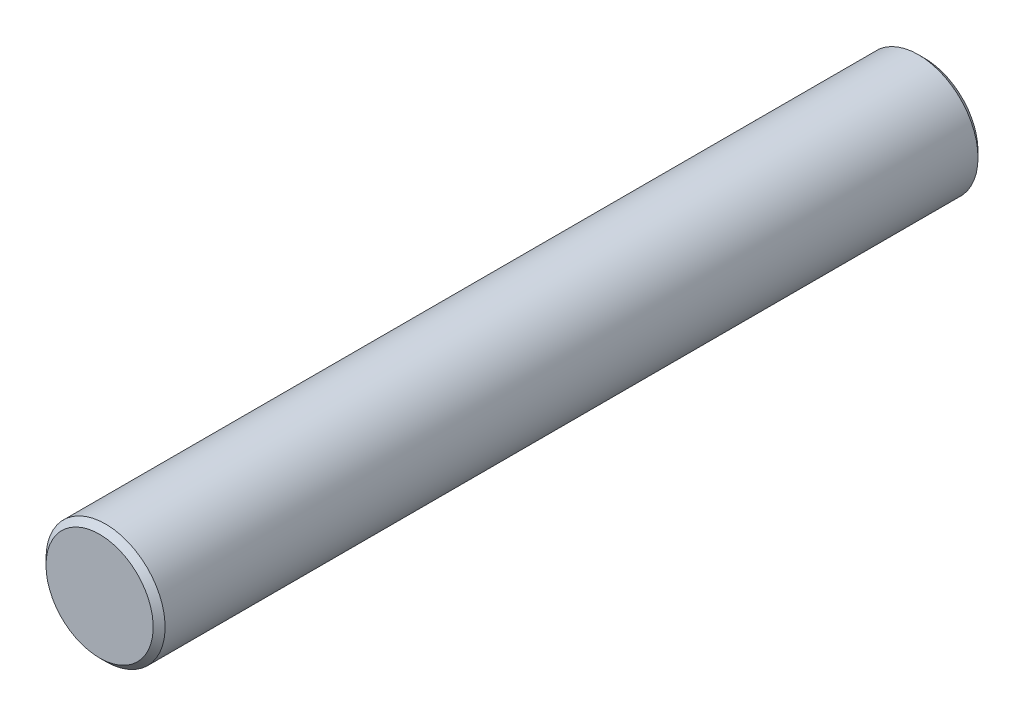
ISO-10303-21;
HEADER;
FILE_DESCRIPTION(('STEP AP214'),'2;1');
FILE_NAME('part.step','',(''),(''),'','','');
FILE_SCHEMA(('AUTOMOTIVE_DESIGN { 1 0 10303 214 1 1 1 1 }'));
ENDSEC;
DATA;
#1=APPLICATION_CONTEXT('core data for automotive mechanical design processes');
#2=APPLICATION_PROTOCOL_DEFINITION('international standard','automotive_design',2000,#1);
#3=PRODUCT_CONTEXT('',#1,'mechanical');
#4=PRODUCT('Part','Part','',(#3));
#5=PRODUCT_RELATED_PRODUCT_CATEGORY('part','',(#4));
#6=PRODUCT_DEFINITION_FORMATION('','',#4);
#7=PRODUCT_DEFINITION_CONTEXT('part definition',#1,'design');
#8=PRODUCT_DEFINITION('design','',#6,#7);
#9=PRODUCT_DEFINITION_SHAPE('','',#8);
#10=(LENGTH_UNIT() NAMED_UNIT(*) SI_UNIT(.MILLI.,.METRE.));
#11=(NAMED_UNIT(*) PLANE_ANGLE_UNIT() SI_UNIT($,.RADIAN.));
#12=(NAMED_UNIT(*) SI_UNIT($,.STERADIAN.) SOLID_ANGLE_UNIT());
#13=UNCERTAINTY_MEASURE_WITH_UNIT(LENGTH_MEASURE(1.E-05),#10,'distance_accuracy_value','');
#14=(GEOMETRIC_REPRESENTATION_CONTEXT(3) GLOBAL_UNCERTAINTY_ASSIGNED_CONTEXT((#13)) GLOBAL_UNIT_ASSIGNED_CONTEXT((#10,
#11,#12)) REPRESENTATION_CONTEXT('',''));
#15=CARTESIAN_POINT('',(0.,0.,0.));
#16=DIRECTION('',(0.,0.,1.));
#17=DIRECTION('',(1.,0.,0.));
#18=AXIS2_PLACEMENT_3D('',#15,#16,#17);
#19=CARTESIAN_POINT('',(0.,0.,-88.4999999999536));
#20=DIRECTION('',(0.,0.,-1.));
#21=DIRECTION('',(-1.,0.,0.));
#22=AXIS2_PLACEMENT_3D('',#19,#20,#21);
#23=CONICAL_SURFACE('',#22,7.000000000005,1.02974425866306);
#24=CARTESIAN_POINT('',(-5.6843418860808E-11,0.,-84.2939756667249));
#25=VERTEX_POINT('',#24);
#26=VERTEX_LOOP('',#25);
#27=FACE_BOUND('',#26,.T.);
#28=CARTESIAN_POINT('',(0.,0.,-88.5));
#29=DIRECTION('',(0.,0.,-1.));
#30=DIRECTION('',(-1.,0.,0.));
#31=AXIS2_PLACEMENT_3D('',#28,#29,#30);
#32=CIRCLE('',#31,6.99999999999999);
#33=CARTESIAN_POINT('',(-6.99999999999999,0.,-88.5));
#34=VERTEX_POINT('',#33);
#35=EDGE_CURVE('E32',#34,#34,#32,.T.);
#36=ORIENTED_EDGE('',*,*,#35,.T.);
#37=EDGE_LOOP('',(#36));
#38=FACE_BOUND('',#37,.T.);
#39=ADVANCED_FACE('F16',(#27,#38),#23,.F.);
#40=CARTESIAN_POINT('',(0.,0.,-138.5));
#41=DIRECTION('',(0.,0.,-1.));
#42=DIRECTION('',(-1.,0.,0.));
#43=AXIS2_PLACEMENT_3D('',#40,#41,#42);
#44=CYLINDRICAL_SURFACE('',#43,6.99999999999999);
#45=ORIENTED_EDGE('',*,*,#35,.F.);
#46=EDGE_LOOP('',(#45));
#47=FACE_BOUND('',#46,.T.);
#48=CARTESIAN_POINT('',(0.,0.,-138.5));
#49=DIRECTION('',(0.,0.,-1.));
#50=DIRECTION('',(-1.,0.,0.));
#51=AXIS2_PLACEMENT_3D('',#48,#49,#50);
#52=CIRCLE('',#51,6.99999999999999);
#53=CARTESIAN_POINT('',(-6.99999999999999,0.,-138.5));
#54=VERTEX_POINT('',#53);
#55=EDGE_CURVE('E19',#54,#54,#52,.T.);
#56=ORIENTED_EDGE('',*,*,#55,.T.);
#57=EDGE_LOOP('',(#56));
#58=FACE_BOUND('',#57,.T.);
#59=ADVANCED_FACE('F29',(#47,#58),#44,.F.);
#60=CARTESIAN_POINT('',(0.,0.,138.5));
#61=DIRECTION('',(0.,0.,1.));
#62=DIRECTION('',(1.,0.,0.));
#63=AXIS2_PLACEMENT_3D('',#60,#61,#62);
#64=PLANE('',#63);
#65=CARTESIAN_POINT('',(0.,0.,138.5));
#66=DIRECTION('',(0.,0.,-1.));
#67=DIRECTION('',(-1.,0.,0.));
#68=AXIS2_PLACEMENT_3D('',#65,#66,#67);
#69=CIRCLE('',#68,18.0000000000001);
#70=CARTESIAN_POINT('',(-18.0000000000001,0.,138.5));
#71=VERTEX_POINT('',#70);
#72=EDGE_CURVE('E36',#71,#71,#69,.T.);
#73=ORIENTED_EDGE('',*,*,#72,.F.);
#74=EDGE_LOOP('',(#73));
#75=FACE_BOUND('',#74,.T.);
#76=ADVANCED_FACE('F46',(#75),#64,.T.);
#77=CARTESIAN_POINT('',(0.,0.,-138.5));
#78=DIRECTION('',(0.,0.,1.));
#79=DIRECTION('',(1.,0.,0.));
#80=AXIS2_PLACEMENT_3D('',#77,#78,#79);
#81=PLANE('',#80);
#82=CARTESIAN_POINT('',(0.,0.,-138.5));
#83=DIRECTION('',(0.,0.,1.));
#84=DIRECTION('',(1.,0.,0.));
#85=AXIS2_PLACEMENT_3D('',#82,#83,#84);
#86=CIRCLE('',#85,18.);
#87=CARTESIAN_POINT('',(18.,0.,-138.5));
#88=VERTEX_POINT('',#87);
#89=EDGE_CURVE('E39',#88,#88,#86,.T.);
#90=ORIENTED_EDGE('',*,*,#89,.F.);
#91=EDGE_LOOP('',(#90));
#92=FACE_BOUND('',#91,.T.);
#93=ORIENTED_EDGE('',*,*,#55,.F.);
#94=EDGE_LOOP('',(#93));
#95=FACE_BOUND('',#94,.T.);
#96=ADVANCED_FACE('F48',(#92,#95),#81,.F.);
#97=CARTESIAN_POINT('',(0.,0.,136.5));
#98=DIRECTION('',(0.,0.,-1.));
#99=DIRECTION('',(-1.,0.,0.));
#100=AXIS2_PLACEMENT_3D('',#97,#98,#99);
#101=CONICAL_SURFACE('',#100,20.,0.785398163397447);
#102=CARTESIAN_POINT('',(0.,0.,136.5));
#103=DIRECTION('',(0.,0.,-1.));
#104=DIRECTION('',(-1.,0.,0.));
#105=AXIS2_PLACEMENT_3D('',#102,#103,#104);
#106=CIRCLE('',#105,20.);
#107=CARTESIAN_POINT('',(-20.,0.,136.5));
#108=VERTEX_POINT('',#107);
#109=EDGE_CURVE('E23',#108,#108,#106,.T.);
#110=ORIENTED_EDGE('',*,*,#109,.F.);
#111=EDGE_LOOP('',(#110));
#112=FACE_BOUND('',#111,.T.);
#113=ORIENTED_EDGE('',*,*,#72,.T.);
#114=EDGE_LOOP('',(#113));
#115=FACE_BOUND('',#114,.T.);
#116=ADVANCED_FACE('F44',(#112,#115),#101,.T.);
#117=CARTESIAN_POINT('',(0.,0.,-136.5));
#118=DIRECTION('',(0.,0.,1.));
#119=DIRECTION('',(1.,0.,0.));
#120=AXIS2_PLACEMENT_3D('',#117,#118,#119);
#121=CONICAL_SURFACE('',#120,20.,0.785398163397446);
#122=CARTESIAN_POINT('',(0.,0.,-136.5));
#123=DIRECTION('',(0.,0.,-1.));
#124=DIRECTION('',(-1.,0.,0.));
#125=AXIS2_PLACEMENT_3D('',#122,#123,#124);
#126=CIRCLE('',#125,20.);
#127=CARTESIAN_POINT('',(-20.,0.,-136.5));
#128=VERTEX_POINT('',#127);
#129=EDGE_CURVE('E11',#128,#128,#126,.F.);
#130=ORIENTED_EDGE('',*,*,#129,.F.);
#131=EDGE_LOOP('',(#130));
#132=FACE_BOUND('',#131,.T.);
#133=ORIENTED_EDGE('',*,*,#89,.T.);
#134=EDGE_LOOP('',(#133));
#135=FACE_BOUND('',#134,.T.);
#136=ADVANCED_FACE('F59',(#132,#135),#121,.T.);
#137=CARTESIAN_POINT('',(0.,0.,138.5));
#138=DIRECTION('',(0.,0.,-1.));
#139=DIRECTION('',(-1.,0.,0.));
#140=AXIS2_PLACEMENT_3D('',#137,#138,#139);
#141=CYLINDRICAL_SURFACE('',#140,20.);
#142=ORIENTED_EDGE('',*,*,#129,.T.);
#143=EDGE_LOOP('',(#142));
#144=FACE_BOUND('',#143,.T.);
#145=ORIENTED_EDGE('',*,*,#109,.T.);
#146=EDGE_LOOP('',(#145));
#147=FACE_BOUND('',#146,.T.);
#148=ADVANCED_FACE('F57',(#144,#147),#141,.T.);
#149=CLOSED_SHELL('',(#39,#59,#76,#96,#116,#136,#148));
#150=MANIFOLD_SOLID_BREP('B1',#149);
#151=ADVANCED_BREP_SHAPE_REPRESENTATION('',(#18,#150),#14);
#152=SHAPE_DEFINITION_REPRESENTATION(#9,#151);
ENDSEC;
END-ISO-10303-21;
